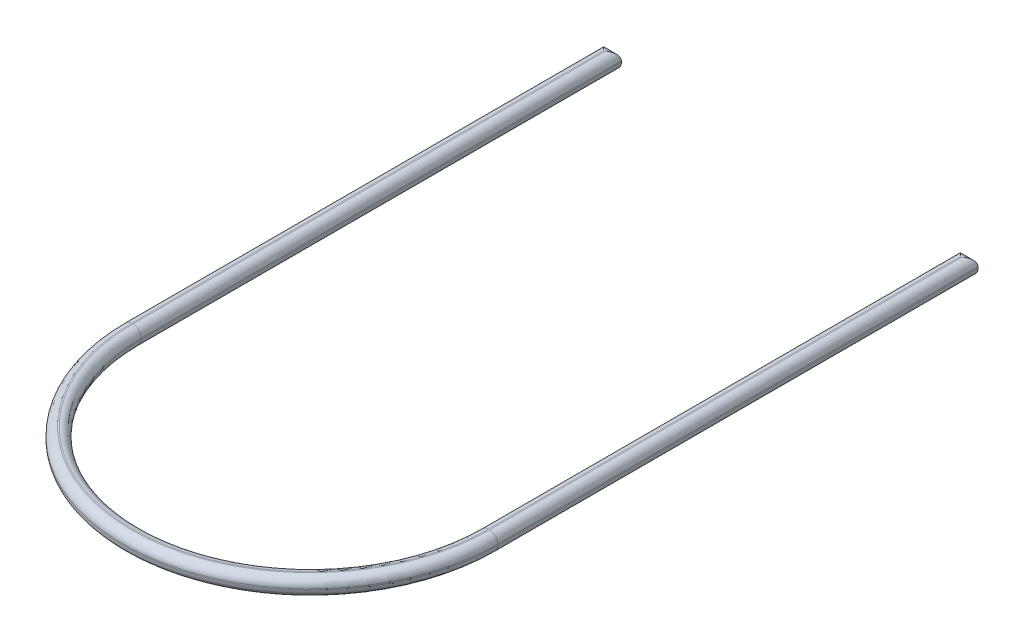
ISO-10303-21;
HEADER;
FILE_DESCRIPTION(('STEP AP214'),'2;1');
FILE_NAME('part.step','',(''),(''),'','','');
FILE_SCHEMA(('AUTOMOTIVE_DESIGN { 1 0 10303 214 1 1 1 1 }'));
ENDSEC;
DATA;
#1=APPLICATION_CONTEXT('core data for automotive mechanical design processes');
#2=APPLICATION_PROTOCOL_DEFINITION('international standard','automotive_design',2000,#1);
#3=PRODUCT_CONTEXT('',#1,'mechanical');
#4=PRODUCT('Part','Part','',(#3));
#5=PRODUCT_RELATED_PRODUCT_CATEGORY('part','',(#4));
#6=PRODUCT_DEFINITION_FORMATION('','',#4);
#7=PRODUCT_DEFINITION_CONTEXT('part definition',#1,'design');
#8=PRODUCT_DEFINITION('design','',#6,#7);
#9=PRODUCT_DEFINITION_SHAPE('','',#8);
#10=(LENGTH_UNIT() NAMED_UNIT(*) SI_UNIT(.MILLI.,.METRE.));
#11=(NAMED_UNIT(*) PLANE_ANGLE_UNIT() SI_UNIT($,.RADIAN.));
#12=(NAMED_UNIT(*) SI_UNIT($,.STERADIAN.) SOLID_ANGLE_UNIT());
#13=UNCERTAINTY_MEASURE_WITH_UNIT(LENGTH_MEASURE(1.E-05),#10,'distance_accuracy_value','');
#14=(GEOMETRIC_REPRESENTATION_CONTEXT(3) GLOBAL_UNCERTAINTY_ASSIGNED_CONTEXT((#13)) GLOBAL_UNIT_ASSIGNED_CONTEXT((#10,
#11,#12)) REPRESENTATION_CONTEXT('',''));
#15=CARTESIAN_POINT('',(0.,0.,0.));
#16=DIRECTION('',(0.,0.,1.));
#17=DIRECTION('',(1.,0.,0.));
#18=AXIS2_PLACEMENT_3D('',#15,#16,#17);
#19=CARTESIAN_POINT('',(0.,-7.93750000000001,0.));
#20=DIRECTION('',(0.,1.,0.));
#21=DIRECTION('',(0.,0.,1.));
#22=AXIS2_PLACEMENT_3D('',#19,#20,#21);
#23=CYLINDRICAL_SURFACE('',#22,84.1375);
#24=DIRECTION('',(0.,1.,0.));
#25=VECTOR('',#24,1.);
#26=CARTESIAN_POINT('',(-84.1375,-7.93750000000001,0.));
#27=LINE('',#26,#25);
#28=CARTESIAN_POINT('',(-84.1375,-4.25449999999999,0.));
#29=VERTEX_POINT('',#28);
#30=CARTESIAN_POINT('',(-84.1375,-3.68299999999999,0.));
#31=VERTEX_POINT('',#30);
#32=EDGE_CURVE('E163',#29,#31,#27,.T.);
#33=ORIENTED_EDGE('',*,*,#32,.F.);
#34=CARTESIAN_POINT('',(0.,-4.25449999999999,0.));
#35=DIRECTION('',(0.,1.,0.));
#36=DIRECTION('',(0.,0.,1.));
#37=AXIS2_PLACEMENT_3D('',#34,#35,#36);
#38=CIRCLE('',#37,84.1375);
#39=CARTESIAN_POINT('',(84.1375,-4.25449999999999,0.));
#40=VERTEX_POINT('',#39);
#41=EDGE_CURVE('E158',#29,#40,#38,.T.);
#42=ORIENTED_EDGE('',*,*,#41,.T.);
#43=DIRECTION('',(0.,1.,0.));
#44=VECTOR('',#43,1.);
#45=CARTESIAN_POINT('',(84.1375,-7.93750000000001,0.));
#46=LINE('',#45,#44);
#47=CARTESIAN_POINT('',(84.1375,-3.68299999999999,0.));
#48=VERTEX_POINT('',#47);
#49=EDGE_CURVE('E160',#40,#48,#46,.T.);
#50=ORIENTED_EDGE('',*,*,#49,.T.);
#51=CARTESIAN_POINT('',(0.,-3.68299999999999,0.));
#52=DIRECTION('',(0.,1.,0.));
#53=DIRECTION('',(0.,0.,1.));
#54=AXIS2_PLACEMENT_3D('',#51,#52,#53);
#55=CIRCLE('',#54,84.1375);
#56=EDGE_CURVE('E169',#48,#31,#55,.F.);
#57=ORIENTED_EDGE('',*,*,#56,.T.);
#58=EDGE_LOOP('',(#33,#42,#50,#57));
#59=FACE_BOUND('',#58,.T.);
#60=ADVANCED_FACE('F43',(#59),#23,.T.);
#61=CARTESIAN_POINT('',(-84.1375,-7.93750000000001,0.));
#62=DIRECTION('',(-1.,0.,0.));
#63=DIRECTION('',(0.,0.,1.));
#64=AXIS2_PLACEMENT_3D('',#61,#62,#63);
#65=PLANE('',#64);
#66=ORIENTED_EDGE('',*,*,#32,.T.);
#67=DIRECTION('',(0.,0.,1.));
#68=VECTOR('',#67,1.);
#69=CARTESIAN_POINT('',(-84.1375,-3.68299999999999,0.));
#70=LINE('',#69,#68);
#71=CARTESIAN_POINT('',(-84.1375,-3.68299999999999,-215.9));
#72=VERTEX_POINT('',#71);
#73=EDGE_CURVE('E245',#31,#72,#70,.F.);
#74=ORIENTED_EDGE('',*,*,#73,.T.);
#75=DIRECTION('',(0.,1.,0.));
#76=VECTOR('',#75,1.);
#77=CARTESIAN_POINT('',(-84.1375,-7.93750000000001,-215.9));
#78=LINE('',#77,#76);
#79=CARTESIAN_POINT('',(-84.1375,-4.25449999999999,-215.9));
#80=VERTEX_POINT('',#79);
#81=EDGE_CURVE('E309',#80,#72,#78,.T.);
#82=ORIENTED_EDGE('',*,*,#81,.F.);
#83=DIRECTION('',(0.,0.,1.));
#84=VECTOR('',#83,1.);
#85=CARTESIAN_POINT('',(-84.1375,-4.25449999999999,0.));
#86=LINE('',#85,#84);
#87=EDGE_CURVE('E243',#80,#29,#86,.T.);
#88=ORIENTED_EDGE('',*,*,#87,.T.);
#89=EDGE_LOOP('',(#66,#74,#82,#88));
#90=FACE_BOUND('',#89,.T.);
#91=ADVANCED_FACE('F349',(#90),#65,.T.);
#92=CARTESIAN_POINT('',(-84.1375,-7.93750000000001,-215.9));
#93=DIRECTION('',(0.,0.,-1.));
#94=DIRECTION('',(-1.,0.,0.));
#95=AXIS2_PLACEMENT_3D('',#92,#93,#94);
#96=PLANE('',#95);
#97=DIRECTION('',(0.,1.,0.));
#98=VECTOR('',#97,1.);
#99=CARTESIAN_POINT('',(-76.2,-7.93750000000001,-215.9));
#100=LINE('',#99,#98);
#101=CARTESIAN_POINT('',(-76.2,-4.25449999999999,-215.9));
#102=VERTEX_POINT('',#101);
#103=CARTESIAN_POINT('',(-76.2,-3.68299999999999,-215.9));
#104=VERTEX_POINT('',#103);
#105=EDGE_CURVE('E306',#102,#104,#100,.T.);
#106=ORIENTED_EDGE('',*,*,#105,.F.);
#107=CARTESIAN_POINT('',(-79.883,-4.25449999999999,-215.9));
#108=DIRECTION('',(0.,0.,-1.));
#109=DIRECTION('',(-1.,0.,0.));
#110=AXIS2_PLACEMENT_3D('',#107,#108,#109);
#111=CIRCLE('',#110,3.683);
#112=CARTESIAN_POINT('',(-79.883,-7.93750000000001,-215.9));
#113=VERTEX_POINT('',#112);
#114=EDGE_CURVE('E227',#102,#113,#111,.T.);
#115=ORIENTED_EDGE('',*,*,#114,.T.);
#116=DIRECTION('',(-1.,0.,0.));
#117=VECTOR('',#116,1.);
#118=CARTESIAN_POINT('',(-84.1375,-7.93750000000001,-215.9));
#119=LINE('',#118,#117);
#120=CARTESIAN_POINT('',(-80.4545,-7.93750000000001,-215.9));
#121=VERTEX_POINT('',#120);
#122=EDGE_CURVE('E181',#113,#121,#119,.T.);
#123=ORIENTED_EDGE('',*,*,#122,.T.);
#124=CARTESIAN_POINT('',(-80.4545,-4.25449999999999,-215.9));
#125=DIRECTION('',(0.,0.,-1.));
#126=DIRECTION('',(-1.,0.,0.));
#127=AXIS2_PLACEMENT_3D('',#124,#125,#126);
#128=CIRCLE('',#127,3.683);
#129=EDGE_CURVE('E223',#121,#80,#128,.T.);
#130=ORIENTED_EDGE('',*,*,#129,.T.);
#131=ORIENTED_EDGE('',*,*,#81,.T.);
#132=DIRECTION('',(-1.,0.,0.));
#133=VECTOR('',#132,1.);
#134=CARTESIAN_POINT('',(-84.1375,-3.68299999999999,-215.9));
#135=LINE('',#134,#133);
#136=EDGE_CURVE('E225',#72,#104,#135,.F.);
#137=ORIENTED_EDGE('',*,*,#136,.T.);
#138=EDGE_LOOP('',(#106,#115,#123,#130,#131,#137));
#139=FACE_BOUND('',#138,.T.);
#140=ADVANCED_FACE('F343',(#139),#96,.T.);
#141=CARTESIAN_POINT('',(-76.2,-7.93750000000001,-215.9));
#142=DIRECTION('',(1.,0.,0.));
#143=DIRECTION('',(0.,0.,-1.));
#144=AXIS2_PLACEMENT_3D('',#141,#142,#143);
#145=PLANE('',#144);
#146=DIRECTION('',(0.,1.,0.));
#147=VECTOR('',#146,1.);
#148=CARTESIAN_POINT('',(-76.2,-7.93750000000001,0.));
#149=LINE('',#148,#147);
#150=CARTESIAN_POINT('',(-76.2,-4.25449999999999,0.));
#151=VERTEX_POINT('',#150);
#152=CARTESIAN_POINT('',(-76.2,-3.68299999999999,0.));
#153=VERTEX_POINT('',#152);
#154=EDGE_CURVE('E300',#151,#153,#149,.T.);
#155=ORIENTED_EDGE('',*,*,#154,.F.);
#156=DIRECTION('',(0.,0.,-1.));
#157=VECTOR('',#156,1.);
#158=CARTESIAN_POINT('',(-76.2,-4.25449999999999,-215.9));
#159=LINE('',#158,#157);
#160=EDGE_CURVE('E221',#151,#102,#159,.T.);
#161=ORIENTED_EDGE('',*,*,#160,.T.);
#162=ORIENTED_EDGE('',*,*,#105,.T.);
#163=DIRECTION('',(0.,0.,-1.));
#164=VECTOR('',#163,1.);
#165=CARTESIAN_POINT('',(-76.2,-3.68299999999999,-215.9));
#166=LINE('',#165,#164);
#167=EDGE_CURVE('E219',#104,#153,#166,.F.);
#168=ORIENTED_EDGE('',*,*,#167,.T.);
#169=EDGE_LOOP('',(#155,#161,#162,#168));
#170=FACE_BOUND('',#169,.T.);
#171=ADVANCED_FACE('F327',(#170),#145,.T.);
#172=CARTESIAN_POINT('',(0.,-7.93750000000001,0.));
#173=DIRECTION('',(0.,1.,0.));
#174=DIRECTION('',(0.,0.,1.));
#175=AXIS2_PLACEMENT_3D('',#172,#173,#174);
#176=CYLINDRICAL_SURFACE('',#175,76.2);
#177=ORIENTED_EDGE('',*,*,#154,.T.);
#178=CARTESIAN_POINT('',(0.,-3.68299999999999,0.));
#179=DIRECTION('',(0.,1.,0.));
#180=DIRECTION('',(0.,0.,1.));
#181=AXIS2_PLACEMENT_3D('',#178,#179,#180);
#182=CIRCLE('',#181,76.2);
#183=CARTESIAN_POINT('',(76.2,-3.68299999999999,0.));
#184=VERTEX_POINT('',#183);
#185=EDGE_CURVE('E11',#153,#184,#182,.T.);
#186=ORIENTED_EDGE('',*,*,#185,.T.);
#187=DIRECTION('',(0.,1.,0.));
#188=VECTOR('',#187,1.);
#189=CARTESIAN_POINT('',(76.2,-7.93750000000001,0.));
#190=LINE('',#189,#188);
#191=CARTESIAN_POINT('',(76.2,-4.25449999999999,0.));
#192=VERTEX_POINT('',#191);
#193=EDGE_CURVE('E294',#192,#184,#190,.T.);
#194=ORIENTED_EDGE('',*,*,#193,.F.);
#195=CARTESIAN_POINT('',(0.,-4.25449999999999,0.));
#196=DIRECTION('',(0.,1.,0.));
#197=DIRECTION('',(0.,0.,1.));
#198=AXIS2_PLACEMENT_3D('',#195,#196,#197);
#199=CIRCLE('',#198,76.2);
#200=EDGE_CURVE('E52',#192,#151,#199,.F.);
#201=ORIENTED_EDGE('',*,*,#200,.T.);
#202=EDGE_LOOP('',(#177,#186,#194,#201));
#203=FACE_BOUND('',#202,.T.);
#204=ADVANCED_FACE('F323',(#203),#176,.F.);
#205=CARTESIAN_POINT('',(76.2,-7.93750000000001,-215.9));
#206=DIRECTION('',(-1.,0.,0.));
#207=DIRECTION('',(0.,0.,1.));
#208=AXIS2_PLACEMENT_3D('',#205,#206,#207);
#209=PLANE('',#208);
#210=DIRECTION('',(0.,1.,0.));
#211=VECTOR('',#210,1.);
#212=CARTESIAN_POINT('',(76.2,-7.93750000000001,-215.9));
#213=LINE('',#212,#211);
#214=CARTESIAN_POINT('',(76.2,-4.25449999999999,-215.9));
#215=VERTEX_POINT('',#214);
#216=CARTESIAN_POINT('',(76.2,-3.68299999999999,-215.9));
#217=VERTEX_POINT('',#216);
#218=EDGE_CURVE('E291',#215,#217,#213,.T.);
#219=ORIENTED_EDGE('',*,*,#218,.F.);
#220=DIRECTION('',(0.,0.,1.));
#221=VECTOR('',#220,1.);
#222=CARTESIAN_POINT('',(76.2,-4.25449999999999,0.));
#223=LINE('',#222,#221);
#224=EDGE_CURVE('E216',#215,#192,#223,.T.);
#225=ORIENTED_EDGE('',*,*,#224,.T.);
#226=ORIENTED_EDGE('',*,*,#193,.T.);
#227=DIRECTION('',(0.,0.,1.));
#228=VECTOR('',#227,1.);
#229=CARTESIAN_POINT('',(76.2,-3.68299999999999,-215.9));
#230=LINE('',#229,#228);
#231=EDGE_CURVE('E168',#184,#217,#230,.F.);
#232=ORIENTED_EDGE('',*,*,#231,.T.);
#233=EDGE_LOOP('',(#219,#225,#226,#232));
#234=FACE_BOUND('',#233,.T.);
#235=ADVANCED_FACE('F290',(#234),#209,.T.);
#236=CARTESIAN_POINT('',(84.1375,-7.93750000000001,-215.9));
#237=DIRECTION('',(0.,0.,-1.));
#238=DIRECTION('',(-1.,0.,0.));
#239=AXIS2_PLACEMENT_3D('',#236,#237,#238);
#240=PLANE('',#239);
#241=DIRECTION('',(0.,1.,0.));
#242=VECTOR('',#241,1.);
#243=CARTESIAN_POINT('',(84.1375,-7.93750000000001,-215.9));
#244=LINE('',#243,#242);
#245=CARTESIAN_POINT('',(84.1375,-4.25449999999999,-215.9));
#246=VERTEX_POINT('',#245);
#247=CARTESIAN_POINT('',(84.1375,-3.68299999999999,-215.9));
#248=VERTEX_POINT('',#247);
#249=EDGE_CURVE('E180',#246,#248,#244,.T.);
#250=ORIENTED_EDGE('',*,*,#249,.F.);
#251=CARTESIAN_POINT('',(80.4545,-4.25449999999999,-215.9));
#252=DIRECTION('',(0.,0.,-1.));
#253=DIRECTION('',(-1.,0.,0.));
#254=AXIS2_PLACEMENT_3D('',#251,#252,#253);
#255=CIRCLE('',#254,3.683);
#256=CARTESIAN_POINT('',(80.4545,-7.93750000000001,-215.9));
#257=VERTEX_POINT('',#256);
#258=EDGE_CURVE('E194',#246,#257,#255,.T.);
#259=ORIENTED_EDGE('',*,*,#258,.T.);
#260=DIRECTION('',(-1.,0.,0.));
#261=VECTOR('',#260,1.);
#262=CARTESIAN_POINT('',(84.1375,-7.93750000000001,-215.9));
#263=LINE('',#262,#261);
#264=CARTESIAN_POINT('',(79.883,-7.93750000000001,-215.9));
#265=VERTEX_POINT('',#264);
#266=EDGE_CURVE('E250',#257,#265,#263,.T.);
#267=ORIENTED_EDGE('',*,*,#266,.T.);
#268=CARTESIAN_POINT('',(79.883,-4.25449999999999,-215.9));
#269=DIRECTION('',(0.,0.,-1.));
#270=DIRECTION('',(-1.,0.,0.));
#271=AXIS2_PLACEMENT_3D('',#268,#269,#270);
#272=CIRCLE('',#271,3.683);
#273=EDGE_CURVE('E197',#265,#215,#272,.T.);
#274=ORIENTED_EDGE('',*,*,#273,.T.);
#275=ORIENTED_EDGE('',*,*,#218,.T.);
#276=DIRECTION('',(-1.,0.,0.));
#277=VECTOR('',#276,1.);
#278=CARTESIAN_POINT('',(84.1375,-3.68299999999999,-215.9));
#279=LINE('',#278,#277);
#280=EDGE_CURVE('E195',#217,#248,#279,.F.);
#281=ORIENTED_EDGE('',*,*,#280,.T.);
#282=EDGE_LOOP('',(#250,#259,#267,#274,#275,#281));
#283=FACE_BOUND('',#282,.T.);
#284=ADVANCED_FACE('F296',(#283),#240,.T.);
#285=CARTESIAN_POINT('',(84.1375,-7.93750000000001,0.));
#286=DIRECTION('',(1.,0.,0.));
#287=DIRECTION('',(0.,0.,-1.));
#288=AXIS2_PLACEMENT_3D('',#285,#286,#287);
#289=PLANE('',#288);
#290=ORIENTED_EDGE('',*,*,#49,.F.);
#291=DIRECTION('',(0.,0.,-1.));
#292=VECTOR('',#291,1.);
#293=CARTESIAN_POINT('',(84.1375,-4.25449999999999,-215.9));
#294=LINE('',#293,#292);
#295=EDGE_CURVE('E176',#40,#246,#294,.T.);
#296=ORIENTED_EDGE('',*,*,#295,.T.);
#297=ORIENTED_EDGE('',*,*,#249,.T.);
#298=DIRECTION('',(0.,0.,-1.));
#299=VECTOR('',#298,1.);
#300=CARTESIAN_POINT('',(84.1375,-3.68299999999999,0.));
#301=LINE('',#300,#299);
#302=EDGE_CURVE('E179',#248,#48,#301,.F.);
#303=ORIENTED_EDGE('',*,*,#302,.T.);
#304=EDGE_LOOP('',(#290,#296,#297,#303));
#305=FACE_BOUND('',#304,.T.);
#306=ADVANCED_FACE('F173',(#305),#289,.T.);
#307=CARTESIAN_POINT('',(0.,-7.93750000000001,0.));
#308=DIRECTION('',(0.,1.,0.));
#309=DIRECTION('',(0.,0.,1.));
#310=AXIS2_PLACEMENT_3D('',#307,#308,#309);
#311=PLANE('',#310);
#312=ORIENTED_EDGE('',*,*,#266,.F.);
#313=DIRECTION('',(0.,0.,-1.));
#314=VECTOR('',#313,1.);
#315=CARTESIAN_POINT('',(80.4545,-7.93750000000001,0.));
#316=LINE('',#315,#314);
#317=CARTESIAN_POINT('',(80.4545,-7.93750000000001,0.));
#318=VERTEX_POINT('',#317);
#319=EDGE_CURVE('E212',#257,#318,#316,.F.);
#320=ORIENTED_EDGE('',*,*,#319,.T.);
#321=CARTESIAN_POINT('',(0.,-7.93750000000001,0.));
#322=DIRECTION('',(0.,1.,0.));
#323=DIRECTION('',(0.,0.,1.));
#324=AXIS2_PLACEMENT_3D('',#321,#322,#323);
#325=CIRCLE('',#324,80.4545);
#326=CARTESIAN_POINT('',(-80.4545,-7.93750000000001,0.));
#327=VERTEX_POINT('',#326);
#328=EDGE_CURVE('E187',#318,#327,#325,.F.);
#329=ORIENTED_EDGE('',*,*,#328,.T.);
#330=DIRECTION('',(0.,0.,1.));
#331=VECTOR('',#330,1.);
#332=CARTESIAN_POINT('',(-80.4545,-7.93750000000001,-215.9));
#333=LINE('',#332,#331);
#334=EDGE_CURVE('E209',#327,#121,#333,.F.);
#335=ORIENTED_EDGE('',*,*,#334,.T.);
#336=ORIENTED_EDGE('',*,*,#122,.F.);
#337=DIRECTION('',(0.,0.,-1.));
#338=VECTOR('',#337,1.);
#339=CARTESIAN_POINT('',(-79.883,-7.93750000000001,0.));
#340=LINE('',#339,#338);
#341=CARTESIAN_POINT('',(-79.883,-7.93750000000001,0.));
#342=VERTEX_POINT('',#341);
#343=EDGE_CURVE('E205',#113,#342,#340,.F.);
#344=ORIENTED_EDGE('',*,*,#343,.T.);
#345=CARTESIAN_POINT('',(0.,-7.93750000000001,0.));
#346=DIRECTION('',(0.,1.,0.));
#347=DIRECTION('',(0.,0.,1.));
#348=AXIS2_PLACEMENT_3D('',#345,#346,#347);
#349=CIRCLE('',#348,79.883);
#350=CARTESIAN_POINT('',(79.883,-7.93750000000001,0.));
#351=VERTEX_POINT('',#350);
#352=EDGE_CURVE('E203',#342,#351,#349,.T.);
#353=ORIENTED_EDGE('',*,*,#352,.T.);
#354=DIRECTION('',(0.,0.,1.));
#355=VECTOR('',#354,1.);
#356=CARTESIAN_POINT('',(79.883,-7.93750000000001,-215.9));
#357=LINE('',#356,#355);
#358=EDGE_CURVE('E207',#351,#265,#357,.F.);
#359=ORIENTED_EDGE('',*,*,#358,.T.);
#360=EDGE_LOOP('',(#312,#320,#329,#335,#336,#344,#353,#359));
#361=FACE_BOUND('',#360,.T.);
#362=ADVANCED_FACE('F338',(#361),#311,.F.);
#363=CARTESIAN_POINT('',(0.,0.,0.));
#364=DIRECTION('',(0.,1.,0.));
#365=DIRECTION('',(0.,0.,1.));
#366=AXIS2_PLACEMENT_3D('',#363,#364,#365);
#367=PLANE('',#366);
#368=DIRECTION('',(-1.,0.,0.));
#369=VECTOR('',#368,1.);
#370=CARTESIAN_POINT('',(0.,0.,-212.217));
#371=LINE('',#370,#369);
#372=CARTESIAN_POINT('',(-79.883,0.,-212.217));
#373=VERTEX_POINT('',#372);
#374=CARTESIAN_POINT('',(-80.4545,0.,-212.217));
#375=VERTEX_POINT('',#374);
#376=EDGE_CURVE('E60',#373,#375,#371,.T.);
#377=ORIENTED_EDGE('',*,*,#376,.T.);
#378=DIRECTION('',(0.,0.,1.));
#379=VECTOR('',#378,1.);
#380=CARTESIAN_POINT('',(-80.4545,0.,0.));
#381=LINE('',#380,#379);
#382=CARTESIAN_POINT('',(-80.4545,0.,0.));
#383=VERTEX_POINT('',#382);
#384=EDGE_CURVE('E241',#375,#383,#381,.T.);
#385=ORIENTED_EDGE('',*,*,#384,.T.);
#386=CARTESIAN_POINT('',(0.,0.,0.));
#387=DIRECTION('',(0.,1.,0.));
#388=DIRECTION('',(0.,0.,1.));
#389=AXIS2_PLACEMENT_3D('',#386,#387,#388);
#390=CIRCLE('',#389,80.4545);
#391=CARTESIAN_POINT('',(80.4545,0.,0.));
#392=VERTEX_POINT('',#391);
#393=EDGE_CURVE('E229',#383,#392,#390,.T.);
#394=ORIENTED_EDGE('',*,*,#393,.T.);
#395=DIRECTION('',(0.,0.,-1.));
#396=VECTOR('',#395,1.);
#397=CARTESIAN_POINT('',(80.4545,0.,0.));
#398=LINE('',#397,#396);
#399=CARTESIAN_POINT('',(80.4545,0.,-212.217));
#400=VERTEX_POINT('',#399);
#401=EDGE_CURVE('E231',#392,#400,#398,.T.);
#402=ORIENTED_EDGE('',*,*,#401,.T.);
#403=DIRECTION('',(-1.,0.,0.));
#404=VECTOR('',#403,1.);
#405=CARTESIAN_POINT('',(0.,0.,-212.217));
#406=LINE('',#405,#404);
#407=CARTESIAN_POINT('',(79.883,0.,-212.217));
#408=VERTEX_POINT('',#407);
#409=EDGE_CURVE('E233',#400,#408,#406,.T.);
#410=ORIENTED_EDGE('',*,*,#409,.T.);
#411=DIRECTION('',(0.,0.,1.));
#412=VECTOR('',#411,1.);
#413=CARTESIAN_POINT('',(79.8830000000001,0.,0.));
#414=LINE('',#413,#412);
#415=CARTESIAN_POINT('',(79.8830000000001,0.,0.));
#416=VERTEX_POINT('',#415);
#417=EDGE_CURVE('E235',#408,#416,#414,.T.);
#418=ORIENTED_EDGE('',*,*,#417,.T.);
#419=CARTESIAN_POINT('',(0.,0.,0.));
#420=DIRECTION('',(0.,1.,0.));
#421=DIRECTION('',(0.,0.,1.));
#422=AXIS2_PLACEMENT_3D('',#419,#420,#421);
#423=CIRCLE('',#422,79.883);
#424=CARTESIAN_POINT('',(-79.883,0.,0.));
#425=VERTEX_POINT('',#424);
#426=EDGE_CURVE('E237',#416,#425,#423,.F.);
#427=ORIENTED_EDGE('',*,*,#426,.T.);
#428=DIRECTION('',(0.,0.,-1.));
#429=VECTOR('',#428,1.);
#430=CARTESIAN_POINT('',(-79.883,0.,0.));
#431=LINE('',#430,#429);
#432=EDGE_CURVE('E65',#425,#373,#431,.T.);
#433=ORIENTED_EDGE('',*,*,#432,.T.);
#434=EDGE_LOOP('',(#377,#385,#394,#402,#410,#418,#427,#433));
#435=FACE_BOUND('',#434,.T.);
#436=ADVANCED_FACE('F361',(#435),#367,.T.);
#437=CARTESIAN_POINT('',(-80.4545,-4.25449999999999,0.));
#438=DIRECTION('',(0.,0.,-1.));
#439=DIRECTION('',(-1.,0.,0.));
#440=AXIS2_PLACEMENT_3D('',#437,#438,#439);
#441=CYLINDRICAL_SURFACE('',#440,3.683);
#442=ORIENTED_EDGE('',*,*,#129,.F.);
#443=ORIENTED_EDGE('',*,*,#334,.F.);
#444=CARTESIAN_POINT('',(-80.4545,-4.25449999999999,0.));
#445=DIRECTION('',(0.,0.,1.));
#446=DIRECTION('',(1.,0.,0.));
#447=AXIS2_PLACEMENT_3D('',#444,#445,#446);
#448=CIRCLE('',#447,3.683);
#449=EDGE_CURVE('E190',#29,#327,#448,.T.);
#450=ORIENTED_EDGE('',*,*,#449,.F.);
#451=ORIENTED_EDGE('',*,*,#87,.F.);
#452=EDGE_LOOP('',(#442,#443,#450,#451));
#453=FACE_BOUND('',#452,.T.);
#454=ADVANCED_FACE('F347',(#453),#441,.T.);
#455=CARTESIAN_POINT('',(0.,-4.25449999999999,0.));
#456=DIRECTION('',(0.,1.,0.));
#457=DIRECTION('',(0.,0.,1.));
#458=AXIS2_PLACEMENT_3D('',#455,#456,#457);
#459=TOROIDAL_SURFACE('',#458,80.4545,3.683);
#460=ORIENTED_EDGE('',*,*,#449,.T.);
#461=ORIENTED_EDGE('',*,*,#328,.F.);
#462=CARTESIAN_POINT('',(80.4545,-4.25449999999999,0.));
#463=DIRECTION('',(0.,0.,-1.));
#464=DIRECTION('',(-1.,0.,0.));
#465=AXIS2_PLACEMENT_3D('',#462,#463,#464);
#466=CIRCLE('',#465,3.683);
#467=EDGE_CURVE('E185',#40,#318,#466,.T.);
#468=ORIENTED_EDGE('',*,*,#467,.F.);
#469=ORIENTED_EDGE('',*,*,#41,.F.);
#470=EDGE_LOOP('',(#460,#461,#468,#469));
#471=FACE_BOUND('',#470,.T.);
#472=ADVANCED_FACE('F186',(#471),#459,.T.);
#473=CARTESIAN_POINT('',(80.4545,-4.25449999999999,0.));
#474=DIRECTION('',(0.,0.,1.));
#475=DIRECTION('',(1.,0.,0.));
#476=AXIS2_PLACEMENT_3D('',#473,#474,#475);
#477=CYLINDRICAL_SURFACE('',#476,3.683);
#478=ORIENTED_EDGE('',*,*,#467,.T.);
#479=ORIENTED_EDGE('',*,*,#319,.F.);
#480=ORIENTED_EDGE('',*,*,#258,.F.);
#481=ORIENTED_EDGE('',*,*,#295,.F.);
#482=EDGE_LOOP('',(#478,#479,#480,#481));
#483=FACE_BOUND('',#482,.T.);
#484=ADVANCED_FACE('F193',(#483),#477,.T.);
#485=CARTESIAN_POINT('',(-79.883,-4.25449999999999,-215.9));
#486=DIRECTION('',(0.,0.,1.));
#487=DIRECTION('',(1.,0.,0.));
#488=AXIS2_PLACEMENT_3D('',#485,#486,#487);
#489=CYLINDRICAL_SURFACE('',#488,3.683);
#490=ORIENTED_EDGE('',*,*,#114,.F.);
#491=ORIENTED_EDGE('',*,*,#160,.F.);
#492=CARTESIAN_POINT('',(-79.883,-4.25449999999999,0.));
#493=DIRECTION('',(0.,0.,1.));
#494=DIRECTION('',(1.,0.,0.));
#495=AXIS2_PLACEMENT_3D('',#492,#493,#494);
#496=CIRCLE('',#495,3.683);
#497=EDGE_CURVE('E191',#342,#151,#496,.T.);
#498=ORIENTED_EDGE('',*,*,#497,.F.);
#499=ORIENTED_EDGE('',*,*,#343,.F.);
#500=EDGE_LOOP('',(#490,#491,#498,#499));
#501=FACE_BOUND('',#500,.T.);
#502=ADVANCED_FACE('F333',(#501),#489,.T.);
#503=CARTESIAN_POINT('',(0.,-4.25449999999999,0.));
#504=DIRECTION('',(0.,1.,0.));
#505=DIRECTION('',(0.,0.,1.));
#506=AXIS2_PLACEMENT_3D('',#503,#504,#505);
#507=TOROIDAL_SURFACE('',#506,79.883,3.683);
#508=ORIENTED_EDGE('',*,*,#497,.T.);
#509=ORIENTED_EDGE('',*,*,#200,.F.);
#510=CARTESIAN_POINT('',(79.883,-4.25449999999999,0.));
#511=DIRECTION('',(0.,0.,-1.));
#512=DIRECTION('',(-1.,0.,0.));
#513=AXIS2_PLACEMENT_3D('',#510,#511,#512);
#514=CIRCLE('',#513,3.683);
#515=EDGE_CURVE('E251',#351,#192,#514,.T.);
#516=ORIENTED_EDGE('',*,*,#515,.F.);
#517=ORIENTED_EDGE('',*,*,#352,.F.);
#518=EDGE_LOOP('',(#508,#509,#516,#517));
#519=FACE_BOUND('',#518,.T.);
#520=ADVANCED_FACE('F337',(#519),#507,.T.);
#521=CARTESIAN_POINT('',(79.883,-4.25449999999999,-215.9));
#522=DIRECTION('',(0.,0.,-1.));
#523=DIRECTION('',(-1.,0.,0.));
#524=AXIS2_PLACEMENT_3D('',#521,#522,#523);
#525=CYLINDRICAL_SURFACE('',#524,3.683);
#526=ORIENTED_EDGE('',*,*,#273,.F.);
#527=ORIENTED_EDGE('',*,*,#358,.F.);
#528=ORIENTED_EDGE('',*,*,#515,.T.);
#529=ORIENTED_EDGE('',*,*,#224,.F.);
#530=EDGE_LOOP('',(#526,#527,#528,#529));
#531=FACE_BOUND('',#530,.T.);
#532=ADVANCED_FACE('F319',(#531),#525,.T.);
#533=CARTESIAN_POINT('',(79.8830000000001,-3.68299999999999,0.));
#534=DIRECTION('',(0.,0.,1.));
#535=DIRECTION('',(1.,0.,0.));
#536=AXIS2_PLACEMENT_3D('',#533,#534,#535);
#537=CYLINDRICAL_SURFACE('',#536,3.683);
#538=CARTESIAN_POINT('',(79.883,-3.68299999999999,-212.217));
#539=DIRECTION('',(-0.707106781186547,0.,0.707106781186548));
#540=DIRECTION('',(-0.707106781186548,0.,-0.707106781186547));
#541=AXIS2_PLACEMENT_3D('',#538,#539,#540);
#542=ELLIPSE('',#541,5.20854855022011,3.683);
#543=EDGE_CURVE('E270',#217,#408,#542,.F.);
#544=ORIENTED_EDGE('',*,*,#543,.F.);
#545=ORIENTED_EDGE('',*,*,#231,.F.);
#546=CARTESIAN_POINT('',(79.8830000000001,-3.68299999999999,0.));
#547=DIRECTION('',(0.,0.,1.));
#548=DIRECTION('',(1.,0.,0.));
#549=AXIS2_PLACEMENT_3D('',#546,#547,#548);
#550=CIRCLE('',#549,3.683);
#551=EDGE_CURVE('E47',#416,#184,#550,.T.);
#552=ORIENTED_EDGE('',*,*,#551,.F.);
#553=ORIENTED_EDGE('',*,*,#417,.F.);
#554=EDGE_LOOP('',(#544,#545,#552,#553));
#555=FACE_BOUND('',#554,.T.);
#556=ADVANCED_FACE('F45',(#555),#537,.T.);
#557=CARTESIAN_POINT('',(0.,-3.68299999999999,0.));
#558=DIRECTION('',(0.,1.,0.));
#559=DIRECTION('',(0.,0.,1.));
#560=AXIS2_PLACEMENT_3D('',#557,#558,#559);
#561=TOROIDAL_SURFACE('',#560,79.883,3.683);
#562=ORIENTED_EDGE('',*,*,#551,.T.);
#563=ORIENTED_EDGE('',*,*,#185,.F.);
#564=CARTESIAN_POINT('',(-79.883,-3.68299999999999,0.));
#565=DIRECTION('',(0.,0.,-1.));
#566=DIRECTION('',(-1.,0.,0.));
#567=AXIS2_PLACEMENT_3D('',#564,#565,#566);
#568=CIRCLE('',#567,3.683);
#569=EDGE_CURVE('E268',#425,#153,#568,.T.);
#570=ORIENTED_EDGE('',*,*,#569,.F.);
#571=ORIENTED_EDGE('',*,*,#426,.F.);
#572=EDGE_LOOP('',(#562,#563,#570,#571));
#573=FACE_BOUND('',#572,.T.);
#574=ADVANCED_FACE('F281',(#573),#561,.T.);
#575=CARTESIAN_POINT('',(0.,-3.68299999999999,-212.217));
#576=DIRECTION('',(-1.,0.,0.));
#577=DIRECTION('',(0.,0.,1.));
#578=AXIS2_PLACEMENT_3D('',#575,#576,#577);
#579=CYLINDRICAL_SURFACE('',#578,3.683);
#580=ORIENTED_EDGE('',*,*,#543,.T.);
#581=ORIENTED_EDGE('',*,*,#409,.F.);
#582=CARTESIAN_POINT('',(80.4545,-3.68299999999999,-212.217));
#583=DIRECTION('',(-0.707106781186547,0.,-0.707106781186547));
#584=DIRECTION('',(0.707106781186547,0.,-0.707106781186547));
#585=AXIS2_PLACEMENT_3D('',#582,#583,#584);
#586=ELLIPSE('',#585,5.20854855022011,3.683);
#587=EDGE_CURVE('E265',#248,#400,#586,.F.);
#588=ORIENTED_EDGE('',*,*,#587,.F.);
#589=ORIENTED_EDGE('',*,*,#280,.F.);
#590=EDGE_LOOP('',(#580,#581,#588,#589));
#591=FACE_BOUND('',#590,.T.);
#592=ADVANCED_FACE('F420',(#591),#579,.T.);
#593=CARTESIAN_POINT('',(-79.883,-3.68299999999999,0.));
#594=DIRECTION('',(0.,0.,-1.));
#595=DIRECTION('',(-1.,0.,0.));
#596=AXIS2_PLACEMENT_3D('',#593,#594,#595);
#597=CYLINDRICAL_SURFACE('',#596,3.683);
#598=ORIENTED_EDGE('',*,*,#569,.T.);
#599=ORIENTED_EDGE('',*,*,#167,.F.);
#600=CARTESIAN_POINT('',(-79.883,-3.68299999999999,-212.217));
#601=DIRECTION('',(-0.707106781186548,0.,-0.707106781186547));
#602=DIRECTION('',(0.707106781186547,0.,-0.707106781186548));
#603=AXIS2_PLACEMENT_3D('',#600,#601,#602);
#604=ELLIPSE('',#603,5.20854855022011,3.683);
#605=EDGE_CURVE('E262',#373,#104,#604,.T.);
#606=ORIENTED_EDGE('',*,*,#605,.F.);
#607=ORIENTED_EDGE('',*,*,#432,.F.);
#608=EDGE_LOOP('',(#598,#599,#606,#607));
#609=FACE_BOUND('',#608,.T.);
#610=ADVANCED_FACE('F354',(#609),#597,.T.);
#611=CARTESIAN_POINT('',(80.4545,-3.68299999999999,0.));
#612=DIRECTION('',(0.,0.,-1.));
#613=DIRECTION('',(-1.,0.,0.));
#614=AXIS2_PLACEMENT_3D('',#611,#612,#613);
#615=CYLINDRICAL_SURFACE('',#614,3.683);
#616=ORIENTED_EDGE('',*,*,#587,.T.);
#617=ORIENTED_EDGE('',*,*,#401,.F.);
#618=CARTESIAN_POINT('',(80.4545,-3.68299999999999,0.));
#619=DIRECTION('',(0.,0.,1.));
#620=DIRECTION('',(1.,0.,0.));
#621=AXIS2_PLACEMENT_3D('',#618,#619,#620);
#622=CIRCLE('',#621,3.683);
#623=EDGE_CURVE('E259',#48,#392,#622,.T.);
#624=ORIENTED_EDGE('',*,*,#623,.F.);
#625=ORIENTED_EDGE('',*,*,#302,.F.);
#626=EDGE_LOOP('',(#616,#617,#624,#625));
#627=FACE_BOUND('',#626,.T.);
#628=ADVANCED_FACE('F365',(#627),#615,.T.);
#629=CARTESIAN_POINT('',(0.,-3.68299999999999,-212.217));
#630=DIRECTION('',(-1.,0.,0.));
#631=DIRECTION('',(0.,0.,1.));
#632=AXIS2_PLACEMENT_3D('',#629,#630,#631);
#633=CYLINDRICAL_SURFACE('',#632,3.683);
#634=ORIENTED_EDGE('',*,*,#605,.T.);
#635=ORIENTED_EDGE('',*,*,#136,.F.);
#636=CARTESIAN_POINT('',(-80.4545,-3.68299999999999,-212.217));
#637=DIRECTION('',(-0.707106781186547,0.,0.707106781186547));
#638=DIRECTION('',(-0.707106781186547,0.,-0.707106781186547));
#639=AXIS2_PLACEMENT_3D('',#636,#637,#638);
#640=ELLIPSE('',#639,5.20854855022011,3.683);
#641=EDGE_CURVE('E257',#375,#72,#640,.T.);
#642=ORIENTED_EDGE('',*,*,#641,.F.);
#643=ORIENTED_EDGE('',*,*,#376,.F.);
#644=EDGE_LOOP('',(#634,#635,#642,#643));
#645=FACE_BOUND('',#644,.T.);
#646=ADVANCED_FACE('F355',(#645),#633,.T.);
#647=CARTESIAN_POINT('',(0.,-3.68299999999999,0.));
#648=DIRECTION('',(0.,1.,0.));
#649=DIRECTION('',(0.,0.,1.));
#650=AXIS2_PLACEMENT_3D('',#647,#648,#649);
#651=TOROIDAL_SURFACE('',#650,80.4545,3.683);
#652=ORIENTED_EDGE('',*,*,#623,.T.);
#653=ORIENTED_EDGE('',*,*,#393,.F.);
#654=CARTESIAN_POINT('',(-80.4545,-3.68299999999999,0.));
#655=DIRECTION('',(0.,0.,-1.));
#656=DIRECTION('',(-1.,0.,0.));
#657=AXIS2_PLACEMENT_3D('',#654,#655,#656);
#658=CIRCLE('',#657,3.683);
#659=EDGE_CURVE('E255',#31,#383,#658,.T.);
#660=ORIENTED_EDGE('',*,*,#659,.F.);
#661=ORIENTED_EDGE('',*,*,#56,.F.);
#662=EDGE_LOOP('',(#652,#653,#660,#661));
#663=FACE_BOUND('',#662,.T.);
#664=ADVANCED_FACE('F368',(#663),#651,.T.);
#665=CARTESIAN_POINT('',(-80.4545,-3.68299999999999,0.));
#666=DIRECTION('',(0.,0.,1.));
#667=DIRECTION('',(1.,0.,0.));
#668=AXIS2_PLACEMENT_3D('',#665,#666,#667);
#669=CYLINDRICAL_SURFACE('',#668,3.683);
#670=ORIENTED_EDGE('',*,*,#641,.T.);
#671=ORIENTED_EDGE('',*,*,#73,.F.);
#672=ORIENTED_EDGE('',*,*,#659,.T.);
#673=ORIENTED_EDGE('',*,*,#384,.F.);
#674=EDGE_LOOP('',(#670,#671,#672,#673));
#675=FACE_BOUND('',#674,.T.);
#676=ADVANCED_FACE('F358',(#675),#669,.T.);
#677=CLOSED_SHELL('',(#60,#91,#140,#171,#204,#235,#284,#306,#362,#436,#454,#472,#484,#502,#520,
#532,#556,#574,#592,#610,#628,#646,#664,#676));
#678=MANIFOLD_SOLID_BREP('B2',#677);
#679=ADVANCED_BREP_SHAPE_REPRESENTATION('',(#18,#678),#14);
#680=SHAPE_DEFINITION_REPRESENTATION(#9,#679);
ENDSEC;
END-ISO-10303-21;
